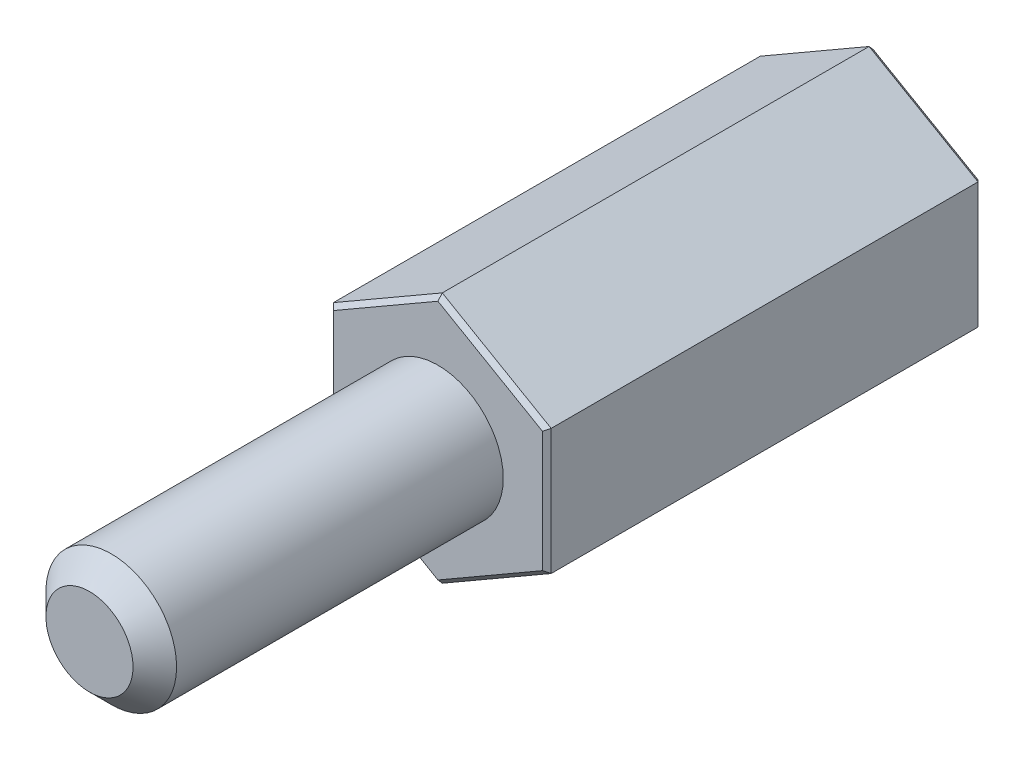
from build123d import *

# Parameters (mm, degrees)
P_IDAT_VYSUNUT_M1_DEPTH  = 10
SKICA2_R                 = 1.5
P_IDAT_VYSUNUT_M2_DEPTH  = 8
ZKOSEN_1_SIZE            = 0.5
ZKOSEN_2_SIZE            = 0.1
SKICA3_R                 = 1.25
ODEBRAT_VYSUNUT_M2_DEPTH = 7
ZKOSEN_5_SIZE            = 1.25


with BuildPart() as part:
    # Skica1 → P_idat vysunut_m1 (new body)
    with BuildSketch(Plane.XY):
        Polygon((2.5, -1.443375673), (2.5, 1.443375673), (0, 2.886751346), (-2.5, 1.443375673), (-2.5, -1.443375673), (0, -2.886751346), align=None)
    extrude(amount=P_IDAT_VYSUNUT_M1_DEPTH)

    # Skica2 → P_idat vysunut_m2 (add)
    with BuildSketch(Plane.XY.offset(10)):
        Circle(SKICA2_R)
    extrude(amount=P_IDAT_VYSUNUT_M2_DEPTH)

    # Zkosen_1
    zkosen_1_edges = [part.edges().sort_by_distance(p)[0] for p in [
        (-1.5, 0, 18),
    ]]
    chamfer(zkosen_1_edges, length=ZKOSEN_1_SIZE)

    # Zkosen_2
    zkosen_2_edges = [part.edges().sort_by_distance(p)[0] for p in [
        (-2.5, 0, 10),
        (-1.25, -2.165063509, 10),
        (1.25, -2.165063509, 10),
        (2.5, 0, 10),
        (1.25, 2.165063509, 10),
        (2.5, 0, 0),
        (1.25, -2.165063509, 0),
        (-1.25, -2.165063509, 0),
        (-1.25, 2.165063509, 10),
        (-2.5, 0, 0),
        (-1.25, 2.165063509, 0),
        (1.25, 2.165063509, 0),
    ]]
    chamfer(zkosen_2_edges, length=ZKOSEN_2_SIZE)

    # Skica3 → Odebrat vysunut_m2 (cut)
    with BuildSketch(Plane(origin=(0, 0, 0), x_dir=(-1, 0, 0), z_dir=(0, 0, -1))):
        Circle(SKICA3_R)
    extrude(amount=-ODEBRAT_VYSUNUT_M2_DEPTH, mode=Mode.SUBTRACT)

    # Zkosen_5
    zkosen_5_edges = [part.edges().sort_by_distance(p)[0] for p in [
        (1.25, 0, 7),
    ]]
    chamfer(zkosen_5_edges, length=ZKOSEN_5_SIZE)


solid = part.part
